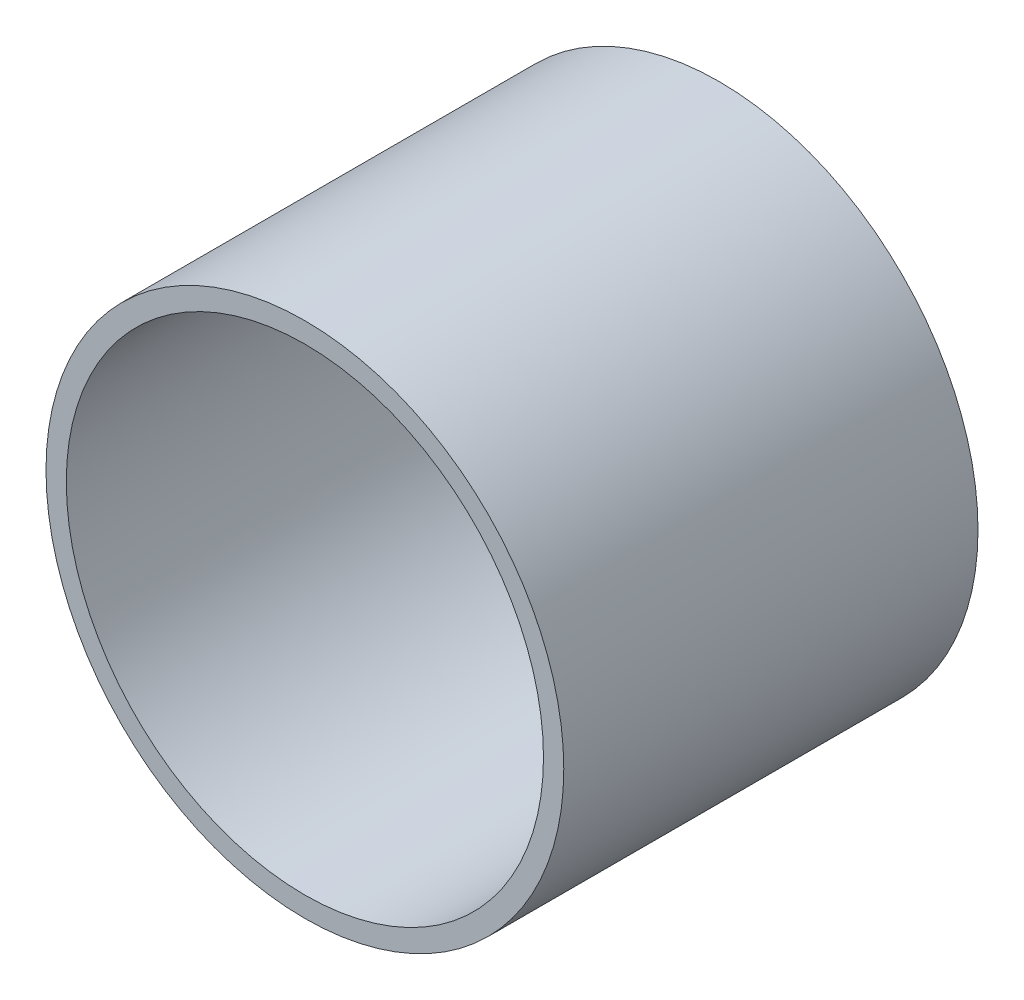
ISO-10303-21;
HEADER;
FILE_DESCRIPTION(('STEP AP214'),'2;1');
FILE_NAME('part.step','',(''),(''),'','','');
FILE_SCHEMA(('AUTOMOTIVE_DESIGN { 1 0 10303 214 1 1 1 1 }'));
ENDSEC;
DATA;
#1=APPLICATION_CONTEXT('core data for automotive mechanical design processes');
#2=APPLICATION_PROTOCOL_DEFINITION('international standard','automotive_design',2000,#1);
#3=PRODUCT_CONTEXT('',#1,'mechanical');
#4=PRODUCT('Part','Part','',(#3));
#5=PRODUCT_RELATED_PRODUCT_CATEGORY('part','',(#4));
#6=PRODUCT_DEFINITION_FORMATION('','',#4);
#7=PRODUCT_DEFINITION_CONTEXT('part definition',#1,'design');
#8=PRODUCT_DEFINITION('design','',#6,#7);
#9=PRODUCT_DEFINITION_SHAPE('','',#8);
#10=(LENGTH_UNIT() NAMED_UNIT(*) SI_UNIT(.MILLI.,.METRE.));
#11=(NAMED_UNIT(*) PLANE_ANGLE_UNIT() SI_UNIT($,.RADIAN.));
#12=(NAMED_UNIT(*) SI_UNIT($,.STERADIAN.) SOLID_ANGLE_UNIT());
#13=UNCERTAINTY_MEASURE_WITH_UNIT(LENGTH_MEASURE(1.E-05),#10,'distance_accuracy_value','');
#14=(GEOMETRIC_REPRESENTATION_CONTEXT(3) GLOBAL_UNCERTAINTY_ASSIGNED_CONTEXT((#13)) GLOBAL_UNIT_ASSIGNED_CONTEXT((#10,
#11,#12)) REPRESENTATION_CONTEXT('',''));
#15=CARTESIAN_POINT('',(0.,0.,0.));
#16=DIRECTION('',(0.,0.,1.));
#17=DIRECTION('',(1.,0.,0.));
#18=AXIS2_PLACEMENT_3D('',#15,#16,#17);
#19=CARTESIAN_POINT('',(0.,0.,-25.4));
#20=DIRECTION('',(0.,0.,1.));
#21=DIRECTION('',(1.,0.,0.));
#22=AXIS2_PLACEMENT_3D('',#19,#20,#21);
#23=CYLINDRICAL_SURFACE('',#22,14.6304);
#24=CARTESIAN_POINT('',(0.,0.,-25.4));
#25=DIRECTION('',(0.,0.,-1.));
#26=DIRECTION('',(-1.,0.,0.));
#27=AXIS2_PLACEMENT_3D('',#24,#25,#26);
#28=CIRCLE('',#27,14.6304);
#29=CARTESIAN_POINT('',(-14.6304,0.,-25.4));
#30=VERTEX_POINT('',#29);
#31=EDGE_CURVE('E44',#30,#30,#28,.T.);
#32=ORIENTED_EDGE('',*,*,#31,.T.);
#33=EDGE_LOOP('',(#32));
#34=FACE_BOUND('',#33,.T.);
#35=CARTESIAN_POINT('',(0.,0.,0.));
#36=DIRECTION('',(0.,0.,-1.));
#37=DIRECTION('',(-1.,0.,0.));
#38=AXIS2_PLACEMENT_3D('',#35,#36,#37);
#39=CIRCLE('',#38,14.6304);
#40=CARTESIAN_POINT('',(-14.6304,0.,0.));
#41=VERTEX_POINT('',#40);
#42=EDGE_CURVE('E50',#41,#41,#39,.T.);
#43=ORIENTED_EDGE('',*,*,#42,.F.);
#44=EDGE_LOOP('',(#43));
#45=FACE_BOUND('',#44,.T.);
#46=ADVANCED_FACE('F37',(#34,#45),#23,.F.);
#47=CARTESIAN_POINT('',(0.,0.,-25.4));
#48=DIRECTION('',(0.,0.,1.));
#49=DIRECTION('',(1.,0.,0.));
#50=AXIS2_PLACEMENT_3D('',#47,#48,#49);
#51=CYLINDRICAL_SURFACE('',#50,15.875);
#52=CARTESIAN_POINT('',(0.,0.,-25.4));
#53=DIRECTION('',(0.,0.,-1.));
#54=DIRECTION('',(-1.,0.,0.));
#55=AXIS2_PLACEMENT_3D('',#52,#53,#54);
#56=CIRCLE('',#55,15.875);
#57=CARTESIAN_POINT('',(-15.875,0.,-25.4));
#58=VERTEX_POINT('',#57);
#59=EDGE_CURVE('E11',#58,#58,#56,.T.);
#60=ORIENTED_EDGE('',*,*,#59,.F.);
#61=EDGE_LOOP('',(#60));
#62=FACE_BOUND('',#61,.T.);
#63=CARTESIAN_POINT('',(0.,0.,0.));
#64=DIRECTION('',(0.,0.,-1.));
#65=DIRECTION('',(-1.,0.,0.));
#66=AXIS2_PLACEMENT_3D('',#63,#64,#65);
#67=CIRCLE('',#66,15.875);
#68=CARTESIAN_POINT('',(-15.875,0.,0.));
#69=VERTEX_POINT('',#68);
#70=EDGE_CURVE('E40',#69,#69,#67,.T.);
#71=ORIENTED_EDGE('',*,*,#70,.T.);
#72=EDGE_LOOP('',(#71));
#73=FACE_BOUND('',#72,.T.);
#74=ADVANCED_FACE('F57',(#62,#73),#51,.T.);
#75=CARTESIAN_POINT('',(0.,0.,-25.4));
#76=DIRECTION('',(0.,0.,-1.));
#77=DIRECTION('',(-1.,0.,0.));
#78=AXIS2_PLACEMENT_3D('',#75,#76,#77);
#79=PLANE('',#78);
#80=ORIENTED_EDGE('',*,*,#31,.F.);
#81=EDGE_LOOP('',(#80));
#82=FACE_BOUND('',#81,.T.);
#83=ORIENTED_EDGE('',*,*,#59,.T.);
#84=EDGE_LOOP('',(#83));
#85=FACE_BOUND('',#84,.T.);
#86=ADVANCED_FACE('F61',(#82,#85),#79,.T.);
#87=CARTESIAN_POINT('',(0.,0.,0.));
#88=DIRECTION('',(0.,0.,-1.));
#89=DIRECTION('',(-1.,0.,0.));
#90=AXIS2_PLACEMENT_3D('',#87,#88,#89);
#91=PLANE('',#90);
#92=ORIENTED_EDGE('',*,*,#42,.T.);
#93=EDGE_LOOP('',(#92));
#94=FACE_BOUND('',#93,.T.);
#95=ORIENTED_EDGE('',*,*,#70,.F.);
#96=EDGE_LOOP('',(#95));
#97=FACE_BOUND('',#96,.T.);
#98=ADVANCED_FACE('F59',(#94,#97),#91,.F.);
#99=CLOSED_SHELL('',(#46,#74,#86,#98));
#100=MANIFOLD_SOLID_BREP('B2',#99);
#101=ADVANCED_BREP_SHAPE_REPRESENTATION('',(#18,#100),#14);
#102=SHAPE_DEFINITION_REPRESENTATION(#9,#101);
ENDSEC;
END-ISO-10303-21;
